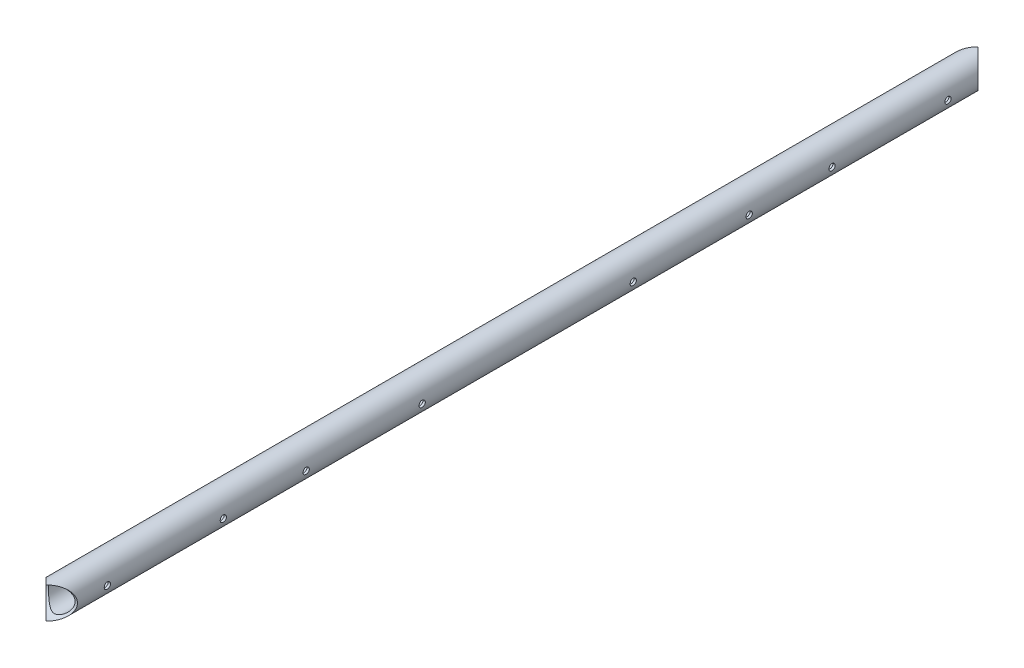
from build123d import *

# Parameters (mm, degrees)
SKETCH1_R          = 24.13
SKETCH1_R_2        = 20.447
EXTRUDE1_DEPTH     = 714.375
SKETCH2_R          = 24.13
CUT_EXTRUDE1_DEPTH = 38.1
SKETCH3_R          = 4.826
CUT_EXTRUDE2_DEPTH = 25.4


with BuildPart() as part:
    # Sketch1 → Extrude1 (new, symmetric)
    with BuildSketch(Plane.XY):
        Circle(SKETCH1_R)
        Circle(SKETCH1_R_2, mode=Mode.SUBTRACT)
    extrude(amount=EXTRUDE1_DEPTH, both=True)

    # Sketch2 → Cut-Extrude1 (cut, symmetric)
    with BuildSketch(Plane(origin=(0, 0, 0), x_dir=(0, 0, -1), z_dir=(1, 0, 0))):
        with Locations((-714.375, 0)):
            Circle(SKETCH2_R)
        with Locations((714.375, 0)):
            Circle(SKETCH2_R)
    extrude(amount=CUT_EXTRUDE1_DEPTH, both=True, mode=Mode.SUBTRACT)

    # Sketch3 → Cut-Extrude2 (cut, symmetric)
    with BuildSketch(Plane(origin=(0, 0, 0), x_dir=(0, -1, 0), z_dir=(1, 0, 0))):
        with Locations(Location((0, 644.398, 0), (0, 0, 90))):
            Circle(SKETCH3_R)
        with Locations(Location((0, 466.598, 0), (0, 0, 90))):
            Circle(SKETCH3_R)
        with Locations(Location((0, 339.598, 0), (0, 0, 90))):
            Circle(SKETCH3_R)
        with Locations(Location((0, 161.798, 0), (0, 0, 90))):
            Circle(SKETCH3_R)
    cut_extrude2 = extrude(amount=CUT_EXTRUDE2_DEPTH, both=True, mode=Mode.SUBTRACT)

    # Mirror1: Cut-Extrude2 across plane
    add(cut_extrude2.mirror(Plane.XY), mode=Mode.SUBTRACT)


solid = part.part
